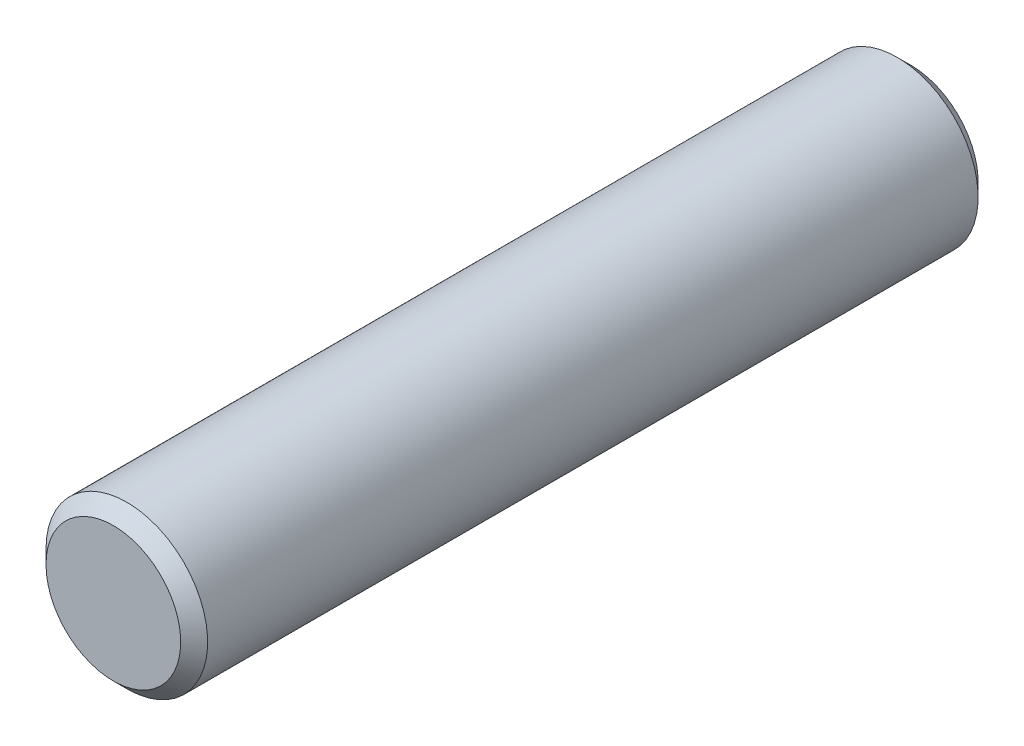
ISO-10303-21;
HEADER;
FILE_DESCRIPTION(('STEP AP214'),'2;1');
FILE_NAME('part.step','',(''),(''),'','','');
FILE_SCHEMA(('AUTOMOTIVE_DESIGN { 1 0 10303 214 1 1 1 1 }'));
ENDSEC;
DATA;
#1=APPLICATION_CONTEXT('core data for automotive mechanical design processes');
#2=APPLICATION_PROTOCOL_DEFINITION('international standard','automotive_design',2000,#1);
#3=PRODUCT_CONTEXT('',#1,'mechanical');
#4=PRODUCT('Part','Part','',(#3));
#5=PRODUCT_RELATED_PRODUCT_CATEGORY('part','',(#4));
#6=PRODUCT_DEFINITION_FORMATION('','',#4);
#7=PRODUCT_DEFINITION_CONTEXT('part definition',#1,'design');
#8=PRODUCT_DEFINITION('design','',#6,#7);
#9=PRODUCT_DEFINITION_SHAPE('','',#8);
#10=(LENGTH_UNIT() NAMED_UNIT(*) SI_UNIT(.MILLI.,.METRE.));
#11=(NAMED_UNIT(*) PLANE_ANGLE_UNIT() SI_UNIT($,.RADIAN.));
#12=(NAMED_UNIT(*) SI_UNIT($,.STERADIAN.) SOLID_ANGLE_UNIT());
#13=UNCERTAINTY_MEASURE_WITH_UNIT(LENGTH_MEASURE(1.E-05),#10,'distance_accuracy_value','');
#14=(GEOMETRIC_REPRESENTATION_CONTEXT(3) GLOBAL_UNCERTAINTY_ASSIGNED_CONTEXT((#13)) GLOBAL_UNIT_ASSIGNED_CONTEXT((#10,
#11,#12)) REPRESENTATION_CONTEXT('',''));
#15=CARTESIAN_POINT('',(0.,0.,0.));
#16=DIRECTION('',(0.,0.,1.));
#17=DIRECTION('',(1.,0.,0.));
#18=AXIS2_PLACEMENT_3D('',#15,#16,#17);
#19=CARTESIAN_POINT('',(0.,0.,11.6426406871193));
#20=DIRECTION('',(0.,0.,-1.));
#21=DIRECTION('',(-1.,0.,0.));
#22=AXIS2_PLACEMENT_3D('',#19,#20,#21);
#23=CYLINDRICAL_SURFACE('',#22,1.5);
#24=CARTESIAN_POINT('',(0.,0.,7.15));
#25=DIRECTION('',(0.,0.,-1.));
#26=DIRECTION('',(-1.,0.,0.));
#27=AXIS2_PLACEMENT_3D('',#24,#25,#26);
#28=CIRCLE('',#27,1.5);
#29=CARTESIAN_POINT('',(-1.5,0.,7.15));
#30=VERTEX_POINT('',#29);
#31=EDGE_CURVE('E38',#30,#30,#28,.T.);
#32=ORIENTED_EDGE('',*,*,#31,.T.);
#33=EDGE_LOOP('',(#32));
#34=FACE_BOUND('',#33,.T.);
#35=CARTESIAN_POINT('',(0.,0.,-7.15));
#36=DIRECTION('',(0.,0.,-1.));
#37=DIRECTION('',(-1.,0.,0.));
#38=AXIS2_PLACEMENT_3D('',#35,#36,#37);
#39=CIRCLE('',#38,1.5);
#40=CARTESIAN_POINT('',(-1.5,0.,-7.15));
#41=VERTEX_POINT('',#40);
#42=EDGE_CURVE('E42',#41,#41,#39,.F.);
#43=ORIENTED_EDGE('',*,*,#42,.T.);
#44=EDGE_LOOP('',(#43));
#45=FACE_BOUND('',#44,.T.);
#46=ADVANCED_FACE('F28',(#34,#45),#23,.T.);
#47=CARTESIAN_POINT('',(-3.87499999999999,5.,7.4));
#48=DIRECTION('',(0.,0.,-1.));
#49=DIRECTION('',(-1.,0.,0.));
#50=AXIS2_PLACEMENT_3D('',#47,#48,#49);
#51=PLANE('',#50);
#52=CARTESIAN_POINT('',(0.,0.,7.4));
#53=DIRECTION('',(0.,0.,-1.));
#54=DIRECTION('',(-1.,0.,0.));
#55=AXIS2_PLACEMENT_3D('',#52,#53,#54);
#56=CIRCLE('',#55,1.25);
#57=CARTESIAN_POINT('',(-1.25,0.,7.4));
#58=VERTEX_POINT('',#57);
#59=EDGE_CURVE('E34',#58,#58,#56,.F.);
#60=ORIENTED_EDGE('',*,*,#59,.T.);
#61=EDGE_LOOP('',(#60));
#62=FACE_BOUND('',#61,.T.);
#63=ADVANCED_FACE('F61',(#62),#51,.F.);
#64=CARTESIAN_POINT('',(-3.87499999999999,5.,-7.4));
#65=DIRECTION('',(0.,0.,-1.));
#66=DIRECTION('',(-1.,0.,0.));
#67=AXIS2_PLACEMENT_3D('',#64,#65,#66);
#68=PLANE('',#67);
#69=CARTESIAN_POINT('',(0.,0.,-7.4));
#70=DIRECTION('',(0.,0.,-1.));
#71=DIRECTION('',(-1.,0.,0.));
#72=AXIS2_PLACEMENT_3D('',#69,#70,#71);
#73=CIRCLE('',#72,1.25);
#74=CARTESIAN_POINT('',(-1.25,0.,-7.4));
#75=VERTEX_POINT('',#74);
#76=EDGE_CURVE('E10',#75,#75,#73,.T.);
#77=ORIENTED_EDGE('',*,*,#76,.T.);
#78=EDGE_LOOP('',(#77));
#79=FACE_BOUND('',#78,.T.);
#80=ADVANCED_FACE('F57',(#79),#68,.T.);
#81=CARTESIAN_POINT('',(0.,0.,7.15));
#82=DIRECTION('',(0.,0.,-1.));
#83=DIRECTION('',(-1.,0.,0.));
#84=AXIS2_PLACEMENT_3D('',#81,#82,#83);
#85=CONICAL_SURFACE('',#84,1.5,0.785398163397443);
#86=ORIENTED_EDGE('',*,*,#59,.F.);
#87=EDGE_LOOP('',(#86));
#88=FACE_BOUND('',#87,.T.);
#89=ORIENTED_EDGE('',*,*,#31,.F.);
#90=EDGE_LOOP('',(#89));
#91=FACE_BOUND('',#90,.T.);
#92=ADVANCED_FACE('F51',(#88,#91),#85,.T.);
#93=CARTESIAN_POINT('',(0.,0.,-7.15));
#94=DIRECTION('',(0.,0.,1.));
#95=DIRECTION('',(1.,0.,0.));
#96=AXIS2_PLACEMENT_3D('',#93,#94,#95);
#97=CONICAL_SURFACE('',#96,1.5,0.785398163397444);
#98=ORIENTED_EDGE('',*,*,#76,.F.);
#99=EDGE_LOOP('',(#98));
#100=FACE_BOUND('',#99,.T.);
#101=ORIENTED_EDGE('',*,*,#42,.F.);
#102=EDGE_LOOP('',(#101));
#103=FACE_BOUND('',#102,.T.);
#104=ADVANCED_FACE('F49',(#100,#103),#97,.T.);
#105=CLOSED_SHELL('',(#46,#63,#80,#92,#104));
#106=MANIFOLD_SOLID_BREP('B2',#105);
#107=ADVANCED_BREP_SHAPE_REPRESENTATION('',(#18,#106),#14);
#108=SHAPE_DEFINITION_REPRESENTATION(#9,#107);
ENDSEC;
END-ISO-10303-21;
